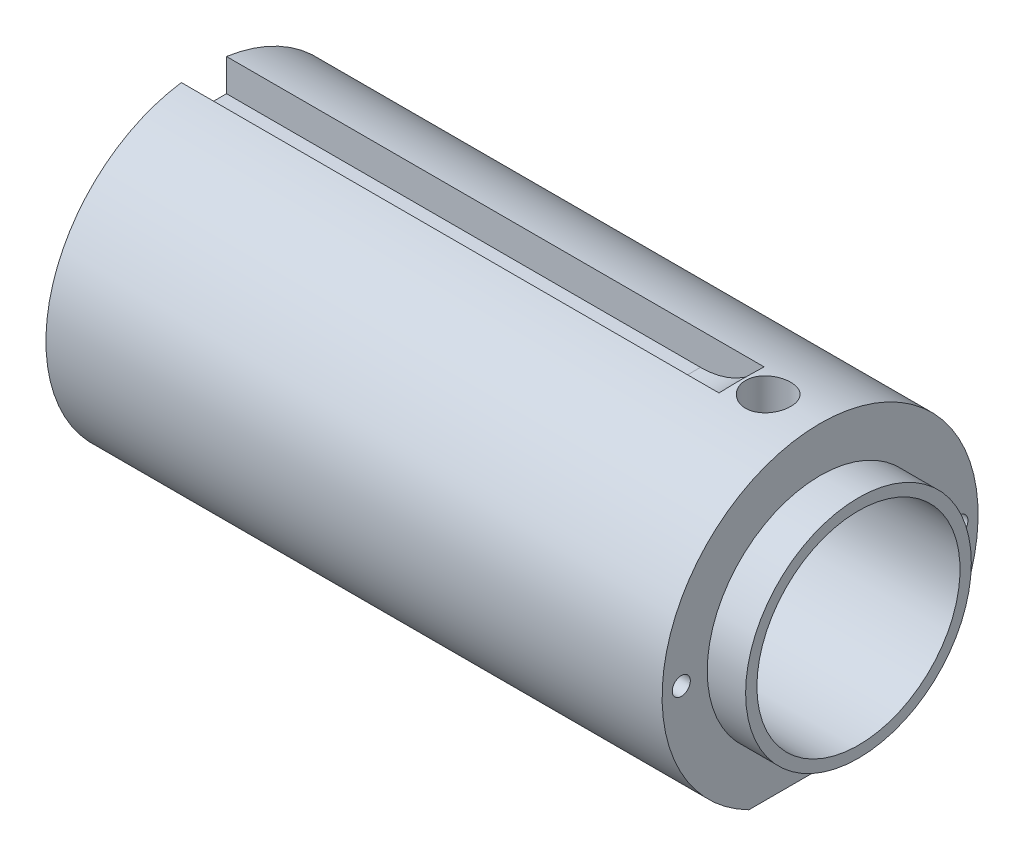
ISO-10303-21;
HEADER;
FILE_DESCRIPTION(('STEP AP214'),'2;1');
FILE_NAME('part.step','',(''),(''),'','','');
FILE_SCHEMA(('AUTOMOTIVE_DESIGN { 1 0 10303 214 1 1 1 1 }'));
ENDSEC;
DATA;
#1=APPLICATION_CONTEXT('core data for automotive mechanical design processes');
#2=APPLICATION_PROTOCOL_DEFINITION('international standard','automotive_design',2000,#1);
#3=PRODUCT_CONTEXT('',#1,'mechanical');
#4=PRODUCT('Part','Part','',(#3));
#5=PRODUCT_RELATED_PRODUCT_CATEGORY('part','',(#4));
#6=PRODUCT_DEFINITION_FORMATION('','',#4);
#7=PRODUCT_DEFINITION_CONTEXT('part definition',#1,'design');
#8=PRODUCT_DEFINITION('design','',#6,#7);
#9=PRODUCT_DEFINITION_SHAPE('','',#8);
#10=(LENGTH_UNIT() NAMED_UNIT(*) SI_UNIT(.MILLI.,.METRE.));
#11=(NAMED_UNIT(*) PLANE_ANGLE_UNIT() SI_UNIT($,.RADIAN.));
#12=(NAMED_UNIT(*) SI_UNIT($,.STERADIAN.) SOLID_ANGLE_UNIT());
#13=UNCERTAINTY_MEASURE_WITH_UNIT(LENGTH_MEASURE(1.E-05),#10,'distance_accuracy_value','');
#14=(GEOMETRIC_REPRESENTATION_CONTEXT(3) GLOBAL_UNCERTAINTY_ASSIGNED_CONTEXT((#13)) GLOBAL_UNIT_ASSIGNED_CONTEXT((#10,
#11,#12)) REPRESENTATION_CONTEXT('',''));
#15=CARTESIAN_POINT('',(0.,0.,0.));
#16=DIRECTION('',(0.,0.,1.));
#17=DIRECTION('',(1.,0.,0.));
#18=AXIS2_PLACEMENT_3D('',#15,#16,#17);
#19=CARTESIAN_POINT('',(58.,-12.5,-14.0663374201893));
#20=DIRECTION('',(0.,1.,0.));
#21=DIRECTION('',(0.,0.,1.));
#22=AXIS2_PLACEMENT_3D('',#19,#20,#21);
#23=PLANE('',#22);
#24=DIRECTION('',(0.,0.,-1.));
#25=VECTOR('',#24,1.);
#26=CARTESIAN_POINT('',(54.6,-12.5,0.));
#27=LINE('',#26,#25);
#28=CARTESIAN_POINT('',(54.6,-12.5,6.30476010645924));
#29=VERTEX_POINT('',#28);
#30=CARTESIAN_POINT('',(54.6,-12.5,-6.30476010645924));
#31=VERTEX_POINT('',#30);
#32=EDGE_CURVE('E11',#29,#31,#27,.T.);
#33=ORIENTED_EDGE('',*,*,#32,.F.);
#34=DIRECTION('',(-1.,0.,0.));
#35=VECTOR('',#34,1.);
#36=CARTESIAN_POINT('',(0.,-12.5,6.30476010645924));
#37=LINE('',#36,#35);
#38=CARTESIAN_POINT('',(0.,-12.5,6.30476010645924));
#39=VERTEX_POINT('',#38);
#40=EDGE_CURVE('E271',#39,#29,#37,.F.);
#41=ORIENTED_EDGE('',*,*,#40,.F.);
#42=DIRECTION('',(0.,0.,-1.));
#43=VECTOR('',#42,1.);
#44=CARTESIAN_POINT('',(0.,-12.5,-14.0663374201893));
#45=LINE('',#44,#43);
#46=CARTESIAN_POINT('',(0.,-12.5,-6.30476010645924));
#47=VERTEX_POINT('',#46);
#48=EDGE_CURVE('E123',#39,#47,#45,.T.);
#49=ORIENTED_EDGE('',*,*,#48,.T.);
#50=DIRECTION('',(-1.,0.,0.));
#51=VECTOR('',#50,1.);
#52=CARTESIAN_POINT('',(0.,-12.5,-6.30476010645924));
#53=LINE('',#52,#51);
#54=EDGE_CURVE('E44',#31,#47,#53,.T.);
#55=ORIENTED_EDGE('',*,*,#54,.F.);
#56=EDGE_LOOP('',(#33,#41,#49,#55));
#57=FACE_BOUND('',#56,.T.);
#58=CARTESIAN_POINT('',(18.,-12.5,0.));
#59=DIRECTION('',(0.,-1.,0.));
#60=DIRECTION('',(0.,0.,-1.));
#61=AXIS2_PLACEMENT_3D('',#58,#59,#60);
#62=CIRCLE('',#61,2.99999999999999);
#63=CARTESIAN_POINT('',(18.,-12.5,-2.99999999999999));
#64=VERTEX_POINT('',#63);
#65=EDGE_CURVE('E113',#64,#64,#62,.T.);
#66=ORIENTED_EDGE('',*,*,#65,.F.);
#67=EDGE_LOOP('',(#66));
#68=FACE_BOUND('',#67,.T.);
#69=ADVANCED_FACE('F29',(#57,#68),#23,.F.);
#70=CARTESIAN_POINT('',(0.,0.,0.));
#71=DIRECTION('',(-1.,0.,0.));
#72=DIRECTION('',(0.,0.,1.));
#73=AXIS2_PLACEMENT_3D('',#70,#71,#72);
#74=CYLINDRICAL_SURFACE('',#73,9.1);
#75=CARTESIAN_POINT('',(14.,0.,0.));
#76=DIRECTION('',(-1.,0.,0.));
#77=DIRECTION('',(0.,0.,1.));
#78=AXIS2_PLACEMENT_3D('',#75,#76,#77);
#79=CIRCLE('',#78,9.1);
#80=CARTESIAN_POINT('',(14.,0.,9.1));
#81=VERTEX_POINT('',#80);
#82=EDGE_CURVE('E197',#81,#81,#79,.T.);
#83=ORIENTED_EDGE('',*,*,#82,.F.);
#84=EDGE_LOOP('',(#83));
#85=FACE_BOUND('',#84,.T.);
#86=CARTESIAN_POINT('',(0.,0.,0.));
#87=DIRECTION('',(-1.,0.,0.));
#88=DIRECTION('',(0.,0.,1.));
#89=AXIS2_PLACEMENT_3D('',#86,#87,#88);
#90=CIRCLE('',#89,9.1);
#91=CARTESIAN_POINT('',(0.,0.,9.1));
#92=VERTEX_POINT('',#91);
#93=EDGE_CURVE('E211',#92,#92,#90,.T.);
#94=ORIENTED_EDGE('',*,*,#93,.T.);
#95=EDGE_LOOP('',(#94));
#96=FACE_BOUND('',#95,.T.);
#97=ADVANCED_FACE('F31',(#85,#96),#74,.F.);
#98=CARTESIAN_POINT('',(0.,9.1,0.));
#99=DIRECTION('',(1.,0.,0.));
#100=DIRECTION('',(0.,0.,-1.));
#101=AXIS2_PLACEMENT_3D('',#98,#99,#100);
#102=PLANE('',#101);
#103=ORIENTED_EDGE('',*,*,#93,.F.);
#104=EDGE_LOOP('',(#103));
#105=FACE_BOUND('',#104,.T.);
#106=CARTESIAN_POINT('',(0.,0.,0.));
#107=DIRECTION('',(-1.,0.,0.));
#108=DIRECTION('',(0.,0.,1.));
#109=AXIS2_PLACEMENT_3D('',#106,#107,#108);
#110=CIRCLE('',#109,14.);
#111=CARTESIAN_POINT('',(0.,13.856406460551,-2.));
#112=VERTEX_POINT('',#111);
#113=EDGE_CURVE('E244',#112,#47,#110,.T.);
#114=ORIENTED_EDGE('',*,*,#113,.T.);
#115=ORIENTED_EDGE('',*,*,#48,.F.);
#116=CARTESIAN_POINT('',(0.,13.856406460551,2.));
#117=VERTEX_POINT('',#116);
#118=EDGE_CURVE('E51',#39,#117,#110,.T.);
#119=ORIENTED_EDGE('',*,*,#118,.T.);
#120=DIRECTION('',(0.,1.,0.));
#121=VECTOR('',#120,1.);
#122=CARTESIAN_POINT('',(0.,9.1,2.));
#123=LINE('',#122,#121);
#124=CARTESIAN_POINT('',(0.,11.,2.));
#125=VERTEX_POINT('',#124);
#126=EDGE_CURVE('E256',#125,#117,#123,.T.);
#127=ORIENTED_EDGE('',*,*,#126,.F.);
#128=DIRECTION('',(0.,0.,-1.));
#129=VECTOR('',#128,1.);
#130=CARTESIAN_POINT('',(0.,11.,0.));
#131=LINE('',#130,#129);
#132=CARTESIAN_POINT('',(0.,11.,-2.));
#133=VERTEX_POINT('',#132);
#134=EDGE_CURVE('E37',#125,#133,#131,.T.);
#135=ORIENTED_EDGE('',*,*,#134,.T.);
#136=DIRECTION('',(0.,1.,0.));
#137=VECTOR('',#136,1.);
#138=CARTESIAN_POINT('',(0.,9.1,-2.));
#139=LINE('',#138,#137);
#140=EDGE_CURVE('E195',#133,#112,#139,.T.);
#141=ORIENTED_EDGE('',*,*,#140,.T.);
#142=EDGE_LOOP('',(#114,#115,#119,#127,#135,#141));
#143=FACE_BOUND('',#142,.T.);
#144=ADVANCED_FACE('F149',(#105,#143),#102,.F.);
#145=CARTESIAN_POINT('',(0.,0.,0.));
#146=DIRECTION('',(-1.,0.,0.));
#147=DIRECTION('',(0.,0.,1.));
#148=AXIS2_PLACEMENT_3D('',#145,#146,#147);
#149=CYLINDRICAL_SURFACE('',#148,14.);
#150=CARTESIAN_POINT('',(50.,13.856406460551,2.00000000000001));
#151=CARTESIAN_POINT('',(49.8882758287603,13.8564082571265,1.9999953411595));
#152=CARTESIAN_POINT('',(49.7764852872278,13.8577723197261,1.99060664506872));
#153=CARTESIAN_POINT('',(49.5560253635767,13.8630779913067,1.95330740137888));
#154=CARTESIAN_POINT('',(49.4473592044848,13.8670221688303,1.92537839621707));
#155=CARTESIAN_POINT('',(49.2363712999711,13.8770324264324,1.85184738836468));
#156=CARTESIAN_POINT('',(49.1340449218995,13.8830969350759,1.8062584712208));
#157=CARTESIAN_POINT('',(48.9385102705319,13.8966626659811,1.69873175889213));
#158=CARTESIAN_POINT('',(48.8453006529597,13.9041636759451,1.63679637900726));
#159=CARTESIAN_POINT('',(48.6699517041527,13.9198182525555,1.49785346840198));
#160=CARTESIAN_POINT('',(48.5878882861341,13.9279757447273,1.42075056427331));
#161=CARTESIAN_POINT('',(48.4378184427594,13.9439890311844,1.25386707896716));
#162=CARTESIAN_POINT('',(48.3698127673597,13.9518448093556,1.16408582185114));
#163=CARTESIAN_POINT('',(48.2495109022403,13.9664103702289,0.973910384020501));
#164=CARTESIAN_POINT('',(48.1972842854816,13.9731150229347,0.8734717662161));
#165=CARTESIAN_POINT('',(48.1104692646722,13.9845795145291,0.665136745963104));
#166=CARTESIAN_POINT('',(48.0758800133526,13.9893394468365,0.557240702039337));
#167=CARTESIAN_POINT('',(48.0255507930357,13.9963505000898,0.337834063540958));
#168=CARTESIAN_POINT('',(48.0096839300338,13.9986185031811,0.226353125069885));
#169=CARTESIAN_POINT('',(47.9968561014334,14.0004479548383,0.00228956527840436));
#170=CARTESIAN_POINT('',(47.9998941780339,14.0000095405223,-0.110292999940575));
#171=CARTESIAN_POINT('',(48.0246893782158,13.9964890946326,-0.332498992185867));
#172=CARTESIAN_POINT('',(48.0463099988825,13.9934263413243,-0.442137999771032));
#173=CARTESIAN_POINT('',(48.1074425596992,13.9850228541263,-0.656215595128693));
#174=CARTESIAN_POINT('',(48.1469549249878,13.9796820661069,-0.760654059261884));
#175=CARTESIAN_POINT('',(48.2428907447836,13.9672894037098,-0.96178196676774));
#176=CARTESIAN_POINT('',(48.2993721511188,13.9602316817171,-1.05844339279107));
#177=CARTESIAN_POINT('',(48.4276004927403,13.9451926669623,-1.24096782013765));
#178=CARTESIAN_POINT('',(48.4993483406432,13.9372113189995,-1.32683017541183));
#179=CARTESIAN_POINT('',(48.656834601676,13.921132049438,-1.48612299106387));
#180=CARTESIAN_POINT('',(48.7426921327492,13.9130337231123,-1.55943569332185));
#181=CARTESIAN_POINT('',(48.9255545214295,13.8977029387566,-1.69062989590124));
#182=CARTESIAN_POINT('',(49.0225594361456,13.8904704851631,-1.74851131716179));
#183=CARTESIAN_POINT('',(49.2250802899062,13.8776905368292,-1.84721301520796));
#184=CARTESIAN_POINT('',(49.3306018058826,13.8721441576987,-1.88802200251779));
#185=CARTESIAN_POINT('',(49.5470975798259,13.8633846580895,-1.95130623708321));
#186=CARTESIAN_POINT('',(49.6580714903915,13.8601713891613,-1.97378265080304));
#187=CARTESIAN_POINT('',(49.88127653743,13.8564698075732,-1.99960390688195));
#188=CARTESIAN_POINT('',(49.9934880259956,13.8559577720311,-2.00311531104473));
#189=CARTESIAN_POINT('',(50.2168978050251,13.8576537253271,-1.99134808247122));
#190=CARTESIAN_POINT('',(50.3280961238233,13.8598616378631,-1.97606997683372));
#191=CARTESIAN_POINT('',(50.5458121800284,13.8667269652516,-1.92729837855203));
#192=CARTESIAN_POINT('',(50.6523487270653,13.8713733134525,-1.89388715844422));
#193=CARTESIAN_POINT('',(50.8583087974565,13.8825829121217,-1.80988306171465));
#194=CARTESIAN_POINT('',(50.9577319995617,13.8891462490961,-1.75928940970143));
#195=CARTESIAN_POINT('',(51.1473918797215,13.9035064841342,-1.64195360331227));
#196=CARTESIAN_POINT('',(51.2375609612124,13.911311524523,-1.57510320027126));
#197=CARTESIAN_POINT('',(51.4054597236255,13.9272509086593,-1.42730277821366));
#198=CARTESIAN_POINT('',(51.4831887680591,13.9353852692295,-1.34635203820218));
#199=CARTESIAN_POINT('',(51.6245952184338,13.9511405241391,-1.17191708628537));
#200=CARTESIAN_POINT('',(51.6881625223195,13.9587570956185,-1.07834317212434));
#201=CARTESIAN_POINT('',(51.7986755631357,13.972552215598,-0.881748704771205));
#202=CARTESIAN_POINT('',(51.845621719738,13.9787308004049,-0.778728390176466));
#203=CARTESIAN_POINT('',(51.9213821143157,13.9889347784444,-0.566515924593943));
#204=CARTESIAN_POINT('',(51.9502575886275,13.9929674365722,-0.457345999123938));
#205=CARTESIAN_POINT('',(51.9892554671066,13.9984555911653,-0.235645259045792));
#206=CARTESIAN_POINT('',(51.9993789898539,13.9999112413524,-0.123114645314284));
#207=CARTESIAN_POINT('',(52.0005602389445,14.0000800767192,0.101043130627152));
#208=CARTESIAN_POINT('',(51.9917868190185,13.998817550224,0.212669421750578));
#209=CARTESIAN_POINT('',(51.955783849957,13.9937406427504,0.432842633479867));
#210=CARTESIAN_POINT('',(51.9285543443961,13.989926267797,0.541389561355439));
#211=CARTESIAN_POINT('',(51.8564700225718,13.9801722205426,0.75228371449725));
#212=CARTESIAN_POINT('',(51.8116258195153,13.9742338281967,0.854634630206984));
#213=CARTESIAN_POINT('',(51.705602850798,13.9608856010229,1.05038570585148));
#214=CARTESIAN_POINT('',(51.6444236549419,13.9534757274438,1.14378562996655));
#215=CARTESIAN_POINT('',(51.5068522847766,13.9379304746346,1.31984194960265));
#216=CARTESIAN_POINT('',(51.4303350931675,13.9297894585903,1.40240016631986));
#217=CARTESIAN_POINT('',(51.2645224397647,13.9137422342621,1.55356716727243));
#218=CARTESIAN_POINT('',(51.1752239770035,13.9058360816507,1.62217266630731));
#219=CARTESIAN_POINT('',(50.9858545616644,13.8911108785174,1.74379523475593));
#220=CARTESIAN_POINT('',(50.8857313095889,13.8842975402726,1.79673154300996));
#221=CARTESIAN_POINT('',(50.6779677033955,13.8725962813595,1.88495902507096));
#222=CARTESIAN_POINT('',(50.5703354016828,13.8677063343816,1.92026877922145));
#223=CARTESIAN_POINT('',(50.3851635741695,13.8615529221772,1.96409255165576));
#224=CARTESIAN_POINT('',(50.3087756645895,13.859633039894,1.97753762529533));
#225=CARTESIAN_POINT('',(50.1549358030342,13.857059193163,1.99549291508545));
#226=CARTESIAN_POINT('',(50.0774838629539,13.8564052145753,2.00000323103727));
#227=CARTESIAN_POINT('',(50.,13.856406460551,2.00000000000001));
#228=B_SPLINE_CURVE_WITH_KNOTS('',3,(#150,#151,#152,#153,#154,#155,#156,#157,#158,#159,#160,
#161,#162,#163,#164,#165,#166,#167,#168,#169,#170,#171,#172,#173,#174,#175,#176,#177,#178,#179,
#180,#181,#182,#183,#184,#185,#186,#187,#188,#189,#190,#191,#192,#193,#194,#195,#196,#197,#198,
#199,#200,#201,#202,#203,#204,#205,#206,#207,#208,#209,#210,#211,#212,#213,#214,#215,#216,#217,
#218,#219,#220,#221,#222,#223,#224,#225,#226,#227),.UNSPECIFIED.,.T.,.F.,(4,2,2,2,2,2,2,2,2,2,2,
2,2,2,2,2,2,2,2,2,2,2,2,2,2,2,2,2,2,2,2,2,2,2,2,2,2,2,4),(0.,0.334889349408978,
0.670112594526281,1.00508792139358,1.34001378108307,1.67711715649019,2.01423851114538,
2.35282530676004,2.69139583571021,3.02765822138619,3.36390357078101,3.69769984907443,
4.03150405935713,4.36646147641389,4.70143892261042,5.03940517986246,5.3773731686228,
5.71556429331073,6.05373389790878,6.38892861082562,6.72411392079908,7.05779100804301,
7.39148315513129,7.72746121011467,8.06345644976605,8.40197921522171,8.74049343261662,
9.07785422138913,9.41519488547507,9.7495337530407,10.0838718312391,10.4180087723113,
10.7521545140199,11.0891434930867,11.426211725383,11.7649881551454,12.103406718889,
12.3356645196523,12.5679197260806),.UNSPECIFIED.);
#229=CARTESIAN_POINT('',(52.,14.,0.));
#230=VERTEX_POINT('',#229);
#231=CARTESIAN_POINT('',(48.,14.,0.));
#232=VERTEX_POINT('',#231);
#233=EDGE_CURVE('E187',#230,#232,#228,.T.);
#234=ORIENTED_EDGE('',*,*,#233,.T.);
#235=EDGE_CURVE('E193',#232,#230,#228,.T.);
#236=ORIENTED_EDGE('',*,*,#235,.T.);
#237=EDGE_LOOP('',(#234,#236));
#238=FACE_BOUND('',#237,.T.);
#239=CARTESIAN_POINT('',(54.6,0.,0.));
#240=DIRECTION('',(-1.,0.,0.));
#241=DIRECTION('',(0.,0.,1.));
#242=AXIS2_PLACEMENT_3D('',#239,#240,#241);
#243=CIRCLE('',#242,14.);
#244=EDGE_CURVE('E237',#29,#31,#243,.T.);
#245=ORIENTED_EDGE('',*,*,#244,.T.);
#246=ORIENTED_EDGE('',*,*,#54,.T.);
#247=ORIENTED_EDGE('',*,*,#113,.F.);
#248=DIRECTION('',(-1.,0.,0.));
#249=VECTOR('',#248,1.);
#250=CARTESIAN_POINT('',(0.,13.856406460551,-2.));
#251=LINE('',#250,#249);
#252=CARTESIAN_POINT('',(47.6418642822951,13.856406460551,-2.));
#253=VERTEX_POINT('',#252);
#254=EDGE_CURVE('E175',#112,#253,#251,.F.);
#255=ORIENTED_EDGE('',*,*,#254,.T.);
#256=CARTESIAN_POINT('',(47.744562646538,14.,0.));
#257=CARTESIAN_POINT('',(47.7445658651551,13.9999982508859,0.296426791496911));
#258=CARTESIAN_POINT('',(47.7380349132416,13.9905743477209,0.592897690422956));
#259=CARTESIAN_POINT('',(47.71157986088,13.9529796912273,1.18411882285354));
#260=CARTESIAN_POINT('',(47.6916519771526,13.9248036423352,1.47886854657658));
#261=CARTESIAN_POINT('',(47.6373654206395,13.8500298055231,2.06494676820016));
#262=CARTESIAN_POINT('',(47.6029949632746,13.8034169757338,2.3562722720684));
#263=CARTESIAN_POINT('',(47.518140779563,13.692446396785,2.93310363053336));
#264=CARTESIAN_POINT('',(47.4676618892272,13.6280939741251,3.21861120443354));
#265=CARTESIAN_POINT('',(47.361364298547,13.4987645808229,3.71951566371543));
#266=CARTESIAN_POINT('',(47.3091603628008,13.4370363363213,3.93652472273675));
#267=CARTESIAN_POINT('',(47.1921049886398,13.3042690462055,4.36423346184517));
#268=CARTESIAN_POINT('',(47.1272535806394,13.233230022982,4.57493315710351));
#269=CARTESIAN_POINT('',(46.9834434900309,13.0830824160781,4.98810504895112));
#270=CARTESIAN_POINT('',(46.9045076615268,13.0039869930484,5.19058993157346));
#271=CARTESIAN_POINT('',(46.7307705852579,12.8391723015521,5.58582495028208));
#272=CARTESIAN_POINT('',(46.6359743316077,12.7534551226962,5.77857812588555));
#273=CARTESIAN_POINT('',(46.4556217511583,12.6002249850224,6.10391840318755));
#274=CARTESIAN_POINT('',(46.374010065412,12.5337331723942,6.23917956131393));
#275=CARTESIAN_POINT('',(46.200534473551,12.3993256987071,6.50219302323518));
#276=CARTESIAN_POINT('',(46.1086731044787,12.331410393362,6.62994717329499));
#277=CARTESIAN_POINT('',(45.9142515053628,12.1954609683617,6.87681340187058));
#278=CARTESIAN_POINT('',(45.8117006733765,12.1274270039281,6.99593291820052));
#279=CARTESIAN_POINT('',(45.5956169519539,11.9926889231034,7.22447522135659));
#280=CARTESIAN_POINT('',(45.4820860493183,11.9259845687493,7.33389975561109));
#281=CARTESIAN_POINT('',(45.1676420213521,11.7537684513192,7.60850030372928));
#282=CARTESIAN_POINT('',(44.9572127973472,11.6506666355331,7.76467352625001));
#283=CARTESIAN_POINT('',(44.6208772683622,11.5080109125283,7.97326013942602));
#284=CARTESIAN_POINT('',(44.5052617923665,11.4624412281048,8.03853303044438));
#285=CARTESIAN_POINT('',(44.2676235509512,11.3762683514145,8.16002692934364));
#286=CARTESIAN_POINT('',(44.1456039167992,11.3356627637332,8.21625230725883));
#287=CARTESIAN_POINT('',(43.8950539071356,11.2601183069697,8.31948711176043));
#288=CARTESIAN_POINT('',(43.766487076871,11.2252170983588,8.36643568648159));
#289=CARTESIAN_POINT('',(43.5044676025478,11.162257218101,8.45025226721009));
#290=CARTESIAN_POINT('',(43.3710148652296,11.1341986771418,8.48712008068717));
#291=CARTESIAN_POINT('',(43.1003466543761,11.0856571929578,8.55042684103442));
#292=CARTESIAN_POINT('',(42.9631322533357,11.0651721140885,8.57686872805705));
#293=CARTESIAN_POINT('',(42.6861208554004,11.0323114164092,8.61909654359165));
#294=CARTESIAN_POINT('',(42.5463241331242,11.019934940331,8.63488359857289));
#295=CARTESIAN_POINT('',(42.2804181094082,11.0044892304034,8.6545566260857));
#296=CARTESIAN_POINT('',(42.1544369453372,11.0005690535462,8.65953112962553));
#297=CARTESIAN_POINT('',(41.9024026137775,10.9995463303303,8.6608303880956));
#298=CARTESIAN_POINT('',(41.7763494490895,11.0024435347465,8.65715545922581));
#299=CARTESIAN_POINT('',(41.5251699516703,11.0149914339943,8.64118427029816));
#300=CARTESIAN_POINT('',(41.400043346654,11.0246400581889,8.62889065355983));
#301=CARTESIAN_POINT('',(41.151610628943,11.0504795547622,8.59577462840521));
#302=CARTESIAN_POINT('',(41.0283045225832,11.0666704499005,8.57495219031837));
#303=CARTESIAN_POINT('',(40.7880694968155,11.1046712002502,8.52567968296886));
#304=CARTESIAN_POINT('',(40.671060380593,11.1262970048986,8.49747840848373));
#305=CARTESIAN_POINT('',(40.4403046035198,11.1749516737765,8.43339006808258));
#306=CARTESIAN_POINT('',(40.3265590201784,11.2019822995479,8.3975004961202));
#307=CARTESIAN_POINT('',(39.9913187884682,11.2904218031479,8.27865699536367));
#308=CARTESIAN_POINT('',(39.7756038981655,11.3592139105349,8.18448358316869));
#309=CARTESIAN_POINT('',(39.3523140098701,11.5158863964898,7.96264722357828));
#310=CARTESIAN_POINT('',(39.1459243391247,11.6046382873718,7.83336718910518));
#311=CARTESIAN_POINT('',(38.7578836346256,11.7923286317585,7.5478531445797));
#312=CARTESIAN_POINT('',(38.5762445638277,11.8912719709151,7.39160618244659));
#313=CARTESIAN_POINT('',(38.2865270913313,12.0645148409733,7.10402474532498));
#314=CARTESIAN_POINT('',(38.1722204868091,12.1378192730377,6.97824481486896));
#315=CARTESIAN_POINT('',(37.9562221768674,12.2846773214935,6.71634024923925));
#316=CARTESIAN_POINT('',(37.8545347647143,12.358231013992,6.58021211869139));
#317=CARTESIAN_POINT('',(37.6631030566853,12.5040164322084,6.29878830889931));
#318=CARTESIAN_POINT('',(37.5733790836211,12.5762457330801,6.15347763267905));
#319=CARTESIAN_POINT('',(37.4052762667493,12.7178988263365,5.85511308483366));
#320=CARTESIAN_POINT('',(37.3269005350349,12.7873218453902,5.70205710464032));
#321=CARTESIAN_POINT('',(37.1537000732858,12.9470852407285,5.33171776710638));
#322=CARTESIAN_POINT('',(37.0634524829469,13.035709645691,5.11154547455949));
#323=CARTESIAN_POINT('',(36.9003602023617,13.203401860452,4.66132654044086));
#324=CARTESIAN_POINT('',(36.8275220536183,13.2824660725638,4.43127622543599));
#325=CARTESIAN_POINT('',(36.6971200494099,13.4295375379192,3.96329720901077));
#326=CARTESIAN_POINT('',(36.6395663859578,13.4975374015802,3.72536336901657));
#327=CARTESIAN_POINT('',(36.5379661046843,13.6213479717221,3.24357170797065));
#328=CARTESIAN_POINT('',(36.4939183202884,13.6771597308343,2.999714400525));
#329=CARTESIAN_POINT('',(36.4167056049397,13.7773302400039,2.50037963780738));
#330=CARTESIAN_POINT('',(36.3838963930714,13.8213065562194,2.24477087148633));
#331=CARTESIAN_POINT('',(36.3297444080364,13.8950893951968,1.73032604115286));
#332=CARTESIAN_POINT('',(36.30840182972,13.9248956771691,1.47148992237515));
#333=CARTESIAN_POINT('',(36.2763450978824,13.9700443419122,0.951797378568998));
#334=CARTESIAN_POINT('',(36.2656354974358,13.9853805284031,0.690940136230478));
#335=CARTESIAN_POINT('',(36.2544380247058,14.0014248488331,0.168550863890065));
#336=CARTESIAN_POINT('',(36.2539508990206,14.0021319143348,-0.0929812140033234));
#337=CARTESIAN_POINT('',(36.2641384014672,13.9875157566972,-0.67030832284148));
#338=CARTESIAN_POINT('',(36.2771743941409,13.9688008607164,-0.985984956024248));
#339=CARTESIAN_POINT('',(36.318915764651,13.9101868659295,-1.61440796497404));
#340=CARTESIAN_POINT('',(36.3476250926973,13.8702824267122,-1.92715358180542));
#341=CARTESIAN_POINT('',(36.4223317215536,13.7699251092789,-2.54709802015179));
#342=CARTESIAN_POINT('',(36.4683202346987,13.7094826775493,-2.85429957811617));
#343=CARTESIAN_POINT('',(36.580077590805,13.5691407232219,-3.46050093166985));
#344=CARTESIAN_POINT('',(36.6458371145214,13.4892503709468,-3.75950451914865));
#345=CARTESIAN_POINT('',(36.7760059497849,13.3399246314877,-4.25327797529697));
#346=CARTESIAN_POINT('',(36.8342650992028,13.2751733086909,-4.45110658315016));
#347=CARTESIAN_POINT('',(36.9628570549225,13.138310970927,-4.84017149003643));
#348=CARTESIAN_POINT('',(37.0331868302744,13.0662018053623,-5.03140942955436));
#349=CARTESIAN_POINT('',(37.1871767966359,12.9158786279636,-5.40561583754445));
#350=CARTESIAN_POINT('',(37.2708175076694,12.8376736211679,-5.58859589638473));
#351=CARTESIAN_POINT('',(37.4528879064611,12.6766047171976,-5.94490317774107));
#352=CARTESIAN_POINT('',(37.5513136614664,12.5937420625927,-6.11823295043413));
#353=CARTESIAN_POINT('',(37.7389764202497,12.4453275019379,-6.41360449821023));
#354=CARTESIAN_POINT('',(37.8248578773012,12.3803300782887,-6.53806180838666));
#355=CARTESIAN_POINT('',(38.0064333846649,12.2498767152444,-6.77932957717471));
#356=CARTESIAN_POINT('',(38.1021250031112,12.1844208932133,-6.89614191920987));
#357=CARTESIAN_POINT('',(38.3035804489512,12.0543423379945,-7.12107453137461));
#358=CARTESIAN_POINT('',(38.4093366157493,11.989719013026,-7.22920129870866));
#359=CARTESIAN_POINT('',(38.6310892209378,11.8626751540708,-7.43583509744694));
#360=CARTESIAN_POINT('',(38.7470839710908,11.8002542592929,-7.53434370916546));
#361=CARTESIAN_POINT('',(38.9687509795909,11.6893585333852,-7.70502754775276));
#362=CARTESIAN_POINT('',(39.0728724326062,11.6403052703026,-7.77884383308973));
#363=CARTESIAN_POINT('',(39.2878035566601,11.5457170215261,-7.91855627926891));
#364=CARTESIAN_POINT('',(39.3986120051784,11.5001813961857,-7.9844538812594));
#365=CARTESIAN_POINT('',(39.6265158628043,11.4135415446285,-8.10782069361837));
#366=CARTESIAN_POINT('',(39.7436122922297,11.3724380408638,-8.16528853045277));
#367=CARTESIAN_POINT('',(39.9834117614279,11.2955824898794,-8.27128183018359));
#368=CARTESIAN_POINT('',(40.1061121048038,11.2598279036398,-8.31981153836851));
#369=CARTESIAN_POINT('',(40.3570780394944,11.1942879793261,-8.40779080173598));
#370=CARTESIAN_POINT('',(40.4853702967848,11.1645362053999,-8.4471894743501));
#371=CARTESIAN_POINT('',(40.7459502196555,11.1119651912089,-8.51622661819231));
#372=CARTESIAN_POINT('',(40.8782379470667,11.0891460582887,-8.54586493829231));
#373=CARTESIAN_POINT('',(41.1457048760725,11.0510127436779,-8.59512010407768));
#374=CARTESIAN_POINT('',(41.2808834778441,11.035697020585,-8.61473900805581));
#375=CARTESIAN_POINT('',(41.5529835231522,11.0129541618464,-8.64379456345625));
#376=CARTESIAN_POINT('',(41.6899048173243,11.0055263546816,-8.653232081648));
#377=CARTESIAN_POINT('',(41.9515608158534,10.9990596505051,-8.66144943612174));
#378=CARTESIAN_POINT('',(42.0762508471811,10.9993081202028,-8.66113462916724));
#379=CARTESIAN_POINT('',(42.3251775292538,11.0064482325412,-8.65205939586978));
#380=CARTESIAN_POINT('',(42.4494140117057,11.0133421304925,-8.64329610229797));
#381=CARTESIAN_POINT('',(42.6963918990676,11.0336249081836,-8.6173888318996));
#382=CARTESIAN_POINT('',(42.8191341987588,11.0470096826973,-8.60025015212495));
#383=CARTESIAN_POINT('',(43.0623730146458,11.079997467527,-8.55770877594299));
#384=CARTESIAN_POINT('',(43.182868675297,11.099602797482,-8.5323029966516));
#385=CARTESIAN_POINT('',(43.4188369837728,11.1442665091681,-8.47388054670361));
#386=CARTESIAN_POINT('',(43.5343593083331,11.1692318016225,-8.44099329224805));
#387=CARTESIAN_POINT('',(43.7617215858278,11.2243046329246,-8.36762134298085));
#388=CARTESIAN_POINT('',(43.8735602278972,11.2544139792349,-8.32713397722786));
#389=CARTESIAN_POINT('',(44.2025304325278,11.3516175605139,-8.19468029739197));
#390=CARTESIAN_POINT('',(44.41331428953,11.4256261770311,-8.09167309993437));
#391=CARTESIAN_POINT('',(44.8279427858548,11.5924836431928,-7.85093354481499));
#392=CARTESIAN_POINT('',(45.0302628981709,11.6862900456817,-7.71127185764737));
#393=CARTESIAN_POINT('',(45.4090168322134,11.8824720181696,-7.40538963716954));
#394=CARTESIAN_POINT('',(45.5854381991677,11.984851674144,-7.23915640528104));
#395=CARTESIAN_POINT('',(45.8683100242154,12.1642280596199,-6.93211464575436));
#396=CARTESIAN_POINT('',(45.9808298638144,12.2406602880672,-6.79646163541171));
#397=CARTESIAN_POINT('',(46.1925459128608,12.3929010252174,-6.51472377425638));
#398=CARTESIAN_POINT('',(46.2917372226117,12.4687092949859,-6.36863511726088));
#399=CARTESIAN_POINT('',(46.4776711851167,12.6181116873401,-6.06725701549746));
#400=CARTESIAN_POINT('',(46.5643894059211,12.6917012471,-5.91195033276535));
#401=CARTESIAN_POINT('',(46.7261040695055,12.8351554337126,-5.59368254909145));
#402=CARTESIAN_POINT('',(46.8010972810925,12.9050190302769,-5.43071935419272));
#403=CARTESIAN_POINT('',(46.9660899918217,13.0648583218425,-5.03684147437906));
#404=CARTESIAN_POINT('',(47.0513812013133,13.1527158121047,-4.8030866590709));
#405=CARTESIAN_POINT('',(47.2042760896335,13.3172530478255,-4.32602877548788));
#406=CARTESIAN_POINT('',(47.2718725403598,13.3939282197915,-4.08272185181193));
#407=CARTESIAN_POINT('',(47.3915761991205,13.5346407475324,-3.58879516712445));
#408=CARTESIAN_POINT('',(47.4436835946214,13.5986782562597,-3.33817549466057));
#409=CARTESIAN_POINT('',(47.5342668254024,13.713134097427,-2.83150083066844));
#410=CARTESIAN_POINT('',(47.5727457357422,13.7635555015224,-2.57544707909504));
#411=CARTESIAN_POINT('',(47.6290393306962,13.8388121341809,-2.12710330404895));
#412=CARTESIAN_POINT('',(47.6496267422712,13.8668897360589,-1.93569026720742));
#413=CARTESIAN_POINT('',(47.6846100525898,13.915137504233,-1.55128011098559));
#414=CARTESIAN_POINT('',(47.6990051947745,13.93530670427,-1.3582828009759));
#415=CARTESIAN_POINT('',(47.7219092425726,13.9676127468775,-0.971327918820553));
#416=CARTESIAN_POINT('',(47.7304198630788,13.9797519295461,-0.777370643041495));
#417=CARTESIAN_POINT('',(47.7417457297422,13.9959464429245,-0.388948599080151));
#418=CARTESIAN_POINT('',(47.7445605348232,14.000001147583,-0.194483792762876));
#419=CARTESIAN_POINT('',(47.744562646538,14.,0.));
#420=B_SPLINE_CURVE_WITH_KNOTS('',3,(#256,#257,#258,#259,#260,#261,#262,#263,#264,#265,#266,
#267,#268,#269,#270,#271,#272,#273,#274,#275,#276,#277,#278,#279,#280,#281,#282,#283,#284,#285,
#286,#287,#288,#289,#290,#291,#292,#293,#294,#295,#296,#297,#298,#299,#300,#301,#302,#303,#304,
#305,#306,#307,#308,#309,#310,#311,#312,#313,#314,#315,#316,#317,#318,#319,#320,#321,#322,#323,
#324,#325,#326,#327,#328,#329,#330,#331,#332,#333,#334,#335,#336,#337,#338,#339,#340,#341,#342,
#343,#344,#345,#346,#347,#348,#349,#350,#351,#352,#353,#354,#355,#356,#357,#358,#359,#360,#361,
#362,#363,#364,#365,#366,#367,#368,#369,#370,#371,#372,#373,#374,#375,#376,#377,#378,#379,#380,
#381,#382,#383,#384,#385,#386,#387,#388,#389,#390,#391,#392,#393,#394,#395,#396,#397,#398,#399,
#400,#401,#402,#403,#404,#405,#406,#407,#408,#409,#410,#411,#412,#413,#414,#415,#416,#417,#418,
#419),.UNSPECIFIED.,.T.,.F.,(4,2,2,2,2,2,2,2,2,2,2,2,2,2,2,2,2,2,2,2,2,2,2,2,2,2,2,2,2,2,2,2,2,
2,2,2,2,2,2,2,2,2,2,2,2,2,2,2,2,2,2,2,2,2,2,2,2,2,2,2,2,2,2,2,2,2,2,2,2,2,2,2,2,2,2,2,2,2,2,2,2,
4),(0.,0.88913402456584,1.77851924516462,2.66863158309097,3.55847694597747,4.25265879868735,
4.94683898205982,5.63990283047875,6.33274885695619,6.84651747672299,7.36015920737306,
7.87335309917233,8.38645430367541,9.22710751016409,9.64780172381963,10.0682921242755,
10.4914553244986,10.9146266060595,11.3376784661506,11.7606855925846,12.1386361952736,
12.5165729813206,12.8943939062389,13.2722161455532,13.6386515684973,14.0052066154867,
14.737652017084,15.5123035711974,16.2873282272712,16.8419131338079,17.3966862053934,
17.9523900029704,18.5082459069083,19.2688779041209,20.0297952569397,20.7912187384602,
21.5525764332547,22.3361874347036,23.119811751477,23.9037714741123,24.6877884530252,
25.6361671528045,26.5847849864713,27.5329210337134,28.4806108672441,29.1285869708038,
29.7764006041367,30.4232747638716,31.0699771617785,31.5633281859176,32.0565572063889,
32.5494137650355,33.042189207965,33.451986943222,33.86170998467,34.2714997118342,
34.681094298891,35.0929192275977,35.5047505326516,35.9164972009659,36.3282088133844,
36.7018245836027,37.0755671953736,37.4490737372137,37.8227197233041,38.1903369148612,
38.5580835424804,39.2929607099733,40.0793989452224,40.866214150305,41.4417950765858,
42.0175870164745,42.5944918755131,43.1715554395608,43.9620476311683,44.7528622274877,
45.543667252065,46.3342937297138,46.9177027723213,47.5011830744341,48.0844932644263,
48.6678486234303),.UNSPECIFIED.);
#421=CARTESIAN_POINT('',(47.6418642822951,13.856406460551,2.));
#422=VERTEX_POINT('',#421);
#423=EDGE_CURVE('E168',#253,#422,#420,.T.);
#424=ORIENTED_EDGE('',*,*,#423,.T.);
#425=DIRECTION('',(-1.,0.,0.));
#426=VECTOR('',#425,1.);
#427=CARTESIAN_POINT('',(0.,13.856406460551,2.));
#428=LINE('',#427,#426);
#429=EDGE_CURVE('E176',#117,#422,#428,.F.);
#430=ORIENTED_EDGE('',*,*,#429,.F.);
#431=ORIENTED_EDGE('',*,*,#118,.F.);
#432=ORIENTED_EDGE('',*,*,#40,.T.);
#433=EDGE_LOOP('',(#245,#246,#247,#255,#424,#430,#431,#432));
#434=FACE_BOUND('',#433,.T.);
#435=ADVANCED_FACE('F178',(#238,#434),#149,.T.);
#436=CARTESIAN_POINT('',(54.6,14.,0.));
#437=DIRECTION('',(-1.,0.,0.));
#438=DIRECTION('',(0.,0.,1.));
#439=AXIS2_PLACEMENT_3D('',#436,#437,#438);
#440=PLANE('',#439);
#441=CARTESIAN_POINT('',(54.6,0.,-12.3));
#442=DIRECTION('',(1.,0.,0.));
#443=DIRECTION('',(0.,0.,-1.));
#444=AXIS2_PLACEMENT_3D('',#441,#442,#443);
#445=CIRCLE('',#444,0.79999999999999);
#446=CARTESIAN_POINT('',(54.6,0.,-13.1));
#447=VERTEX_POINT('',#446);
#448=EDGE_CURVE('E102',#447,#447,#445,.T.);
#449=ORIENTED_EDGE('',*,*,#448,.F.);
#450=EDGE_LOOP('',(#449));
#451=FACE_BOUND('',#450,.T.);
#452=CARTESIAN_POINT('',(54.6,0.,12.3));
#453=DIRECTION('',(1.,0.,0.));
#454=DIRECTION('',(0.,0.,-1.));
#455=AXIS2_PLACEMENT_3D('',#452,#453,#454);
#456=CIRCLE('',#455,0.79999999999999);
#457=CARTESIAN_POINT('',(54.6,0.,11.5));
#458=VERTEX_POINT('',#457);
#459=EDGE_CURVE('E110',#458,#458,#456,.T.);
#460=ORIENTED_EDGE('',*,*,#459,.F.);
#461=EDGE_LOOP('',(#460));
#462=FACE_BOUND('',#461,.T.);
#463=ORIENTED_EDGE('',*,*,#244,.F.);
#464=ORIENTED_EDGE('',*,*,#32,.T.);
#465=EDGE_LOOP('',(#463,#464));
#466=FACE_BOUND('',#465,.T.);
#467=CARTESIAN_POINT('',(54.6,0.,0.));
#468=DIRECTION('',(-1.,0.,0.));
#469=DIRECTION('',(0.,0.,1.));
#470=AXIS2_PLACEMENT_3D('',#467,#468,#469);
#471=CIRCLE('',#470,10.);
#472=CARTESIAN_POINT('',(54.6,0.,10.));
#473=VERTEX_POINT('',#472);
#474=EDGE_CURVE('E231',#473,#473,#471,.T.);
#475=ORIENTED_EDGE('',*,*,#474,.T.);
#476=EDGE_LOOP('',(#475));
#477=FACE_BOUND('',#476,.T.);
#478=ADVANCED_FACE('F182',(#451,#462,#466,#477),#440,.F.);
#479=CARTESIAN_POINT('',(0.,0.,0.));
#480=DIRECTION('',(-1.,0.,0.));
#481=DIRECTION('',(0.,0.,1.));
#482=AXIS2_PLACEMENT_3D('',#479,#480,#481);
#483=CYLINDRICAL_SURFACE('',#482,10.);
#484=ORIENTED_EDGE('',*,*,#474,.F.);
#485=EDGE_LOOP('',(#484));
#486=FACE_BOUND('',#485,.T.);
#487=CARTESIAN_POINT('',(58.,0.,0.));
#488=DIRECTION('',(-1.,0.,0.));
#489=DIRECTION('',(0.,0.,1.));
#490=AXIS2_PLACEMENT_3D('',#487,#488,#489);
#491=CIRCLE('',#490,10.);
#492=CARTESIAN_POINT('',(58.,0.,10.));
#493=VERTEX_POINT('',#492);
#494=EDGE_CURVE('E234',#493,#493,#491,.T.);
#495=ORIENTED_EDGE('',*,*,#494,.T.);
#496=EDGE_LOOP('',(#495));
#497=FACE_BOUND('',#496,.T.);
#498=ADVANCED_FACE('F220',(#486,#497),#483,.T.);
#499=CARTESIAN_POINT('',(58.,10.,0.));
#500=DIRECTION('',(-1.,0.,0.));
#501=DIRECTION('',(0.,0.,1.));
#502=AXIS2_PLACEMENT_3D('',#499,#500,#501);
#503=PLANE('',#502);
#504=ORIENTED_EDGE('',*,*,#494,.F.);
#505=EDGE_LOOP('',(#504));
#506=FACE_BOUND('',#505,.T.);
#507=CARTESIAN_POINT('',(58.,0.,0.));
#508=DIRECTION('',(-1.,0.,0.));
#509=DIRECTION('',(0.,0.,1.));
#510=AXIS2_PLACEMENT_3D('',#507,#508,#509);
#511=CIRCLE('',#510,9.);
#512=CARTESIAN_POINT('',(58.,0.,9.));
#513=VERTEX_POINT('',#512);
#514=EDGE_CURVE('E235',#513,#513,#511,.T.);
#515=ORIENTED_EDGE('',*,*,#514,.T.);
#516=EDGE_LOOP('',(#515));
#517=FACE_BOUND('',#516,.T.);
#518=ADVANCED_FACE('F217',(#506,#517),#503,.F.);
#519=CARTESIAN_POINT('',(0.,0.,0.));
#520=DIRECTION('',(-1.,0.,0.));
#521=DIRECTION('',(0.,0.,1.));
#522=AXIS2_PLACEMENT_3D('',#519,#520,#521);
#523=CYLINDRICAL_SURFACE('',#522,9.);
#524=CARTESIAN_POINT('',(18.,-8.48528137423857,-2.99999999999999));
#525=CARTESIAN_POINT('',(18.1634045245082,-8.48528083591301,-3.00000077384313));
#526=CARTESIAN_POINT('',(18.3268043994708,-8.49005307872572,-2.98660435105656));
#527=CARTESIAN_POINT('',(18.6487632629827,-8.50852722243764,-2.93355339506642));
#528=CARTESIAN_POINT('',(18.8073214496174,-8.52223059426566,-2.89389453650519));
#529=CARTESIAN_POINT('',(19.1148806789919,-8.55684611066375,-2.78986645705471));
#530=CARTESIAN_POINT('',(19.2638997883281,-8.57774411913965,-2.72554566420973));
#531=CARTESIAN_POINT('',(19.5490801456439,-8.62437366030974,-2.57418488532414));
#532=CARTESIAN_POINT('',(19.6852385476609,-8.65010625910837,-2.48713988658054));
#533=CARTESIAN_POINT('',(19.9461598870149,-8.70463468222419,-2.28915343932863));
#534=CARTESIAN_POINT('',(20.0703462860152,-8.73350684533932,-2.17747302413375));
#535=CARTESIAN_POINT('',(20.2986204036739,-8.79041594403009,-1.93496300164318));
#536=CARTESIAN_POINT('',(20.4027048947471,-8.81845274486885,-1.80413032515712));
#537=CARTESIAN_POINT('',(20.5904366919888,-8.87141600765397,-1.52281352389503));
#538=CARTESIAN_POINT('',(20.6734799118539,-8.89624223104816,-1.37190573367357));
#539=CARTESIAN_POINT('',(20.8127747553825,-8.93908760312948,-1.05729366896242));
#540=CARTESIAN_POINT('',(20.8690335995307,-8.95710858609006,-0.893592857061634));
#541=CARTESIAN_POINT('',(20.9512075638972,-8.9837722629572,-0.564086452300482));
#542=CARTESIAN_POINT('',(20.978110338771,-8.99271944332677,-0.398552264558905));
#543=CARTESIAN_POINT('',(21.003948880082,-9.00130824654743,-0.0650936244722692));
#544=CARTESIAN_POINT('',(21.0028918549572,-9.00095226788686,0.102830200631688));
#545=CARTESIAN_POINT('',(20.9734672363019,-8.99118118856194,0.429310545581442));
#546=CARTESIAN_POINT('',(20.9461724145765,-8.98212194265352,0.587976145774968));
#547=CARTESIAN_POINT('',(20.8668210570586,-8.95640902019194,0.898330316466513));
#548=CARTESIAN_POINT('',(20.8147628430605,-8.93975482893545,1.05001841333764));
#549=CARTESIAN_POINT('',(20.6867360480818,-8.90027010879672,1.34445742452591));
#550=CARTESIAN_POINT('',(20.6104621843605,-8.87736127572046,1.48706466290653));
#551=CARTESIAN_POINT('',(20.436420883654,-8.82775179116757,1.75777297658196));
#552=CARTESIAN_POINT('',(20.3386474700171,-8.801050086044,1.88587000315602));
#553=CARTESIAN_POINT('',(20.1189768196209,-8.7451857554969,2.13030259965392));
#554=CARTESIAN_POINT('',(19.9961605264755,-8.71596645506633,2.24580047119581));
#555=CARTESIAN_POINT('',(19.7326538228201,-8.65942005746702,2.45483177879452));
#556=CARTESIAN_POINT('',(19.5919606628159,-8.63209325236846,2.54836182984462));
#557=CARTESIAN_POINT('',(19.2940391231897,-8.58211575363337,2.71196236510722));
#558=CARTESIAN_POINT('',(19.1366036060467,-8.55953727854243,2.78167939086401));
#559=CARTESIAN_POINT('',(18.8112858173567,-8.52244952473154,2.893329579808));
#560=CARTESIAN_POINT('',(18.6434079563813,-8.50793686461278,2.93527438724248));
#561=CARTESIAN_POINT('',(18.3100849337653,-8.48938908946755,2.98848384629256));
#562=CARTESIAN_POINT('',(18.144871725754,-8.48491080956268,3.00104728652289));
#563=CARTESIAN_POINT('',(17.8146715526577,-8.48570016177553,2.99881631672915));
#564=CARTESIAN_POINT('',(17.649684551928,-8.49096602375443,2.98402687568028));
#565=CARTESIAN_POINT('',(17.3305291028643,-8.51020854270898,2.92867695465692));
#566=CARTESIAN_POINT('',(17.1761837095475,-8.52387976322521,2.88901918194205));
#567=CARTESIAN_POINT('',(16.8763691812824,-8.55805661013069,2.7861415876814));
#568=CARTESIAN_POINT('',(16.7309016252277,-8.57856344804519,2.72291758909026));
#569=CARTESIAN_POINT('',(16.447858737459,-8.62490632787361,2.57242302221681));
#570=CARTESIAN_POINT('',(16.3106800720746,-8.65089076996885,2.48445335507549));
#571=CARTESIAN_POINT('',(16.0525618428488,-8.70497306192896,2.28775689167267));
#572=CARTESIAN_POINT('',(15.9316270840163,-8.73307153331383,2.17902397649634));
#573=CARTESIAN_POINT('',(15.7034160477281,-8.78985115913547,1.93767511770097));
#574=CARTESIAN_POINT('',(15.5970768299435,-8.81849530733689,1.80416181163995));
#575=CARTESIAN_POINT('',(15.4082515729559,-8.87180554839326,1.52048187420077));
#576=CARTESIAN_POINT('',(15.3257646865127,-8.89647178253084,1.37031583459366));
#577=CARTESIAN_POINT('',(15.1877396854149,-8.93893217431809,1.05833958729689));
#578=CARTESIAN_POINT('',(15.1320261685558,-8.95677090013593,0.89661336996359));
#579=CARTESIAN_POINT('',(15.0488167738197,-8.98375832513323,0.56537539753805));
#580=CARTESIAN_POINT('',(15.0213107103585,-8.99291016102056,0.395866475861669));
#581=CARTESIAN_POINT('',(14.9962137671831,-9.00125589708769,0.0624460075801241));
#582=CARTESIAN_POINT('',(14.9972776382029,-9.00089760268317,-0.101354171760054));
#583=CARTESIAN_POINT('',(15.0259719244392,-8.99136589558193,-0.426333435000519));
#584=CARTESIAN_POINT('',(15.0536001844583,-8.98219319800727,-0.587512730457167));
#585=CARTESIAN_POINT('',(15.1337467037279,-8.95622744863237,-0.900126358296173));
#586=CARTESIAN_POINT('',(15.1858626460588,-8.93955775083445,-1.05167481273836));
#587=CARTESIAN_POINT('',(15.3131325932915,-8.90031482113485,-1.34393505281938));
#588=CARTESIAN_POINT('',(15.388290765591,-8.87774052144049,-1.48464487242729));
#589=CARTESIAN_POINT('',(15.562708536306,-8.82797606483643,-1.75690204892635));
#590=CARTESIAN_POINT('',(15.6627560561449,-8.80064617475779,-1.88791875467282));
#591=CARTESIAN_POINT('',(15.8827721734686,-8.74478966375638,-2.13174307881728));
#592=CARTESIAN_POINT('',(16.0027471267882,-8.71626266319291,-2.24454486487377));
#593=CARTESIAN_POINT('',(16.2648280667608,-8.65989839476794,-2.45322542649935));
#594=CARTESIAN_POINT('',(16.4076165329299,-8.63213183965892,-2.5482688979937));
#595=CARTESIAN_POINT('',(16.7080032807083,-8.58180579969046,-2.71294302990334));
#596=CARTESIAN_POINT('',(16.865597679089,-8.55924495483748,-2.78258033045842));
#597=CARTESIAN_POINT('',(17.1838854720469,-8.52304002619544,-2.89153148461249));
#598=CARTESIAN_POINT('',(17.3441167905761,-8.50903898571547,-2.93207372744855));
#599=CARTESIAN_POINT('',(17.6695681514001,-8.49016150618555,-2.98630296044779));
#600=CARTESIAN_POINT('',(17.8347864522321,-8.48528191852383,-2.99999921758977));
#601=CARTESIAN_POINT('',(18.,-8.48528137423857,-2.99999999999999));
#602=B_SPLINE_CURVE_WITH_KNOTS('',3,(#524,#525,#526,#527,#528,#529,#530,#531,#532,#533,#534,
#535,#536,#537,#538,#539,#540,#541,#542,#543,#544,#545,#546,#547,#548,#549,#550,#551,#552,#553,
#554,#555,#556,#557,#558,#559,#560,#561,#562,#563,#564,#565,#566,#567,#568,#569,#570,#571,#572,
#573,#574,#575,#576,#577,#578,#579,#580,#581,#582,#583,#584,#585,#586,#587,#588,#589,#590,#591,
#592,#593,#594,#595,#596,#597,#598,#599,#600,#601),.UNSPECIFIED.,.T.,.F.,(4,2,2,2,2,2,2,2,2,2,2,
2,2,2,2,2,2,2,2,2,2,2,2,2,2,2,2,2,2,2,2,2,2,2,2,2,2,2,4),(0.,0.489601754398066,
0.979284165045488,1.46800988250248,1.95684349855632,2.46304012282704,2.96931795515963,
3.48880518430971,4.00815229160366,4.50942956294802,5.01057759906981,5.49207014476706,
5.97359532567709,6.46144964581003,6.94943975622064,7.46040523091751,7.97144938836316,
8.48977919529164,9.00789154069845,9.50262874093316,9.99727607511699,10.4749318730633,
10.9526723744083,11.4455657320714,11.9386045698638,12.4553642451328,12.9721055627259,
13.4854137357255,13.9985364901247,14.487542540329,14.9765089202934,15.4577086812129,
15.9389955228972,16.438065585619,16.9372951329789,17.4560670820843,17.974703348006,
18.4698963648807,18.9649184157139),.UNSPECIFIED.);
#603=CARTESIAN_POINT('',(18.,-8.48528137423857,-2.99999999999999));
#604=VERTEX_POINT('',#603);
#605=EDGE_CURVE('E116',#604,#604,#602,.T.);
#606=ORIENTED_EDGE('',*,*,#605,.T.);
#607=EDGE_LOOP('',(#606));
#608=FACE_BOUND('',#607,.T.);
#609=CARTESIAN_POINT('',(50.,8.77496438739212,2.00000000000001));
#610=CARTESIAN_POINT('',(50.110842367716,8.77496662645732,1.99999624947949));
#611=CARTESIAN_POINT('',(50.2217294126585,8.77708745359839,1.99075413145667));
#612=CARTESIAN_POINT('',(50.4403468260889,8.78532539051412,1.95407223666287));
#613=CARTESIAN_POINT('',(50.548074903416,8.79144532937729,1.92661957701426));
#614=CARTESIAN_POINT('',(50.7571804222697,8.80695492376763,1.8544263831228));
#615=CARTESIAN_POINT('',(50.8585648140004,8.81634092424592,1.80970516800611));
#616=CARTESIAN_POINT('',(51.0523950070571,8.83732066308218,1.70430003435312));
#617=CARTESIAN_POINT('',(51.1448409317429,8.84891437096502,1.64361633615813));
#618=CARTESIAN_POINT('',(51.3197825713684,8.87322903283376,1.50688107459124));
#619=CARTESIAN_POINT('',(51.4020997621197,8.88596479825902,1.43060369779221));
#620=CARTESIAN_POINT('',(51.552882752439,8.91099903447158,1.26533367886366));
#621=CARTESIAN_POINT('',(51.6213474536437,8.92329747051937,1.17634002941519));
#622=CARTESIAN_POINT('',(51.7431907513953,8.94623292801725,0.986963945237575));
#623=CARTESIAN_POINT('',(51.7963972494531,8.95685043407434,0.886468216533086));
#624=CARTESIAN_POINT('',(51.8850998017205,8.97506024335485,0.67768633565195));
#625=CARTESIAN_POINT('',(51.920597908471,8.98265289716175,0.569401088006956));
#626=CARTESIAN_POINT('',(51.9723134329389,8.99385284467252,0.349970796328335));
#627=CARTESIAN_POINT('',(51.9888331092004,8.99752254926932,0.238900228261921));
#628=CARTESIAN_POINT('',(52.0030682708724,9.00067948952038,0.0155076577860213));
#629=CARTESIAN_POINT('',(52.0007859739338,9.00016721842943,-0.0968141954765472));
#630=CARTESIAN_POINT('',(51.977706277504,8.99506549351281,-0.31743592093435));
#631=CARTESIAN_POINT('',(51.9572347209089,8.99054779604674,-0.425771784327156));
#632=CARTESIAN_POINT('',(51.8988773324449,8.97802477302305,-0.637430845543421));
#633=CARTESIAN_POINT('',(51.8609906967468,8.97001928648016,-0.740753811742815));
#634=CARTESIAN_POINT('',(51.7685930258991,8.95130538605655,-0.940353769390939));
#635=CARTESIAN_POINT('',(51.7139592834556,8.94057712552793,-1.03657202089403));
#636=CARTESIAN_POINT('',(51.589709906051,8.91759271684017,-1.21859313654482));
#637=CARTESIAN_POINT('',(51.52009216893,8.90533635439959,-1.30439453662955));
#638=CARTESIAN_POINT('',(51.3660798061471,8.88033165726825,-1.46508498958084));
#639=CARTESIAN_POINT('',(51.2814000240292,8.86757840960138,-1.53970021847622));
#640=CARTESIAN_POINT('',(51.1005972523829,8.84326321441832,-1.67372303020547));
#641=CARTESIAN_POINT('',(51.0044739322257,8.83170130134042,-1.73313017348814));
#642=CARTESIAN_POINT('',(50.8030601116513,8.81106433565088,-1.83517765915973));
#643=CARTESIAN_POINT('',(50.6977417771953,8.8019972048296,-1.87776477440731));
#644=CARTESIAN_POINT('',(50.4811938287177,8.78748514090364,-1.94455269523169));
#645=CARTESIAN_POINT('',(50.3699651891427,8.78203961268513,-1.96875652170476));
#646=CARTESIAN_POINT('',(50.1472600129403,8.77550908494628,-1.99766298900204));
#647=CARTESIAN_POINT('',(50.0358378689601,8.77433480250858,-2.00276498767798));
#648=CARTESIAN_POINT('',(49.8137350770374,8.77623864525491,-1.99440547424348));
#649=CARTESIAN_POINT('',(49.7030543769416,8.77931646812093,-1.9809452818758));
#650=CARTESIAN_POINT('',(49.4869764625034,8.78929328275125,-1.93619037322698));
#651=CARTESIAN_POINT('',(49.3815310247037,8.79614483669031,-1.90511692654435));
#652=CARTESIAN_POINT('',(49.1773433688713,8.81285408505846,-1.82625775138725));
#653=CARTESIAN_POINT('',(49.0786018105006,8.82271207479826,-1.77847038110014));
#654=CARTESIAN_POINT('',(48.8889003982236,8.84451874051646,-1.66666470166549));
#655=CARTESIAN_POINT('',(48.7980886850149,8.85649807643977,-1.60240114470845));
#656=CARTESIAN_POINT('',(48.6283916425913,8.88111742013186,-1.45978704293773));
#657=CARTESIAN_POINT('',(48.5495078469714,8.8937575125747,-1.38143468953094));
#658=CARTESIAN_POINT('',(48.4043486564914,8.91856933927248,-1.21105721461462));
#659=CARTESIAN_POINT('',(48.3383459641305,8.93072732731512,-1.11879740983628));
#660=CARTESIAN_POINT('',(48.222775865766,8.95294911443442,-0.924268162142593));
#661=CARTESIAN_POINT('',(48.1732076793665,8.96301301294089,-0.821999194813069));
#662=CARTESIAN_POINT('',(48.0922898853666,8.97985488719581,-0.611001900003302));
#663=CARTESIAN_POINT('',(48.0608228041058,8.98665400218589,-0.502320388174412));
#664=CARTESIAN_POINT('',(48.0166348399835,8.99629176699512,-0.281045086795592));
#665=CARTESIAN_POINT('',(48.0039111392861,8.99913101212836,-0.168451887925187));
#666=CARTESIAN_POINT('',(47.997701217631,9.00051075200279,0.0548648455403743));
#667=CARTESIAN_POINT('',(48.0038083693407,8.99914211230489,0.165576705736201));
#668=CARTESIAN_POINT('',(48.0341749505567,8.9924552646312,0.384354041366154));
#669=CARTESIAN_POINT('',(48.058434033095,8.98713713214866,0.492419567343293));
#670=CARTESIAN_POINT('',(48.1242183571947,8.97315637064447,0.702510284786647));
#671=CARTESIAN_POINT('',(48.1656842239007,8.9645052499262,0.804554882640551));
#672=CARTESIAN_POINT('',(48.2646478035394,8.94478087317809,1.00029152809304));
#673=CARTESIAN_POINT('',(48.3221471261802,8.93370737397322,1.09398273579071));
#674=CARTESIAN_POINT('',(48.4528622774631,8.91007482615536,1.27233089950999));
#675=CARTESIAN_POINT('',(48.5263630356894,8.89749099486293,1.35677575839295));
#676=CARTESIAN_POINT('',(48.6864221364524,8.87238707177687,1.51227173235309));
#677=CARTESIAN_POINT('',(48.7729836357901,8.85986699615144,1.58331959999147));
#678=CARTESIAN_POINT('',(48.9581544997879,8.83611370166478,1.71095851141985));
#679=CARTESIAN_POINT('',(49.0569146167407,8.82490079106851,1.76733485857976));
#680=CARTESIAN_POINT('',(49.2627368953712,8.80528840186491,1.86260026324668));
#681=CARTESIAN_POINT('',(49.3697920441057,8.79688657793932,1.901503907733));
#682=CARTESIAN_POINT('',(49.5641064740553,8.78537621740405,1.95389349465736));
#683=CARTESIAN_POINT('',(49.6503234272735,8.78149804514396,1.97114982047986));
#684=CARTESIAN_POINT('',(49.8243509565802,8.77629130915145,1.9942042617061));
#685=CARTESIAN_POINT('',(49.9121614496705,8.77496261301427,2.00000297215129));
#686=CARTESIAN_POINT('',(50.,8.77496438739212,2.00000000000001));
#687=B_SPLINE_CURVE_WITH_KNOTS('',3,(#609,#610,#611,#612,#613,#614,#615,#616,#617,#618,#619,
#620,#621,#622,#623,#624,#625,#626,#627,#628,#629,#630,#631,#632,#633,#634,#635,#636,#637,#638,
#639,#640,#641,#642,#643,#644,#645,#646,#647,#648,#649,#650,#651,#652,#653,#654,#655,#656,#657,
#658,#659,#660,#661,#662,#663,#664,#665,#666,#667,#668,#669,#670,#671,#672,#673,#674,#675,#676,
#677,#678,#679,#680,#681,#682,#683,#684,#685,#686),.UNSPECIFIED.,.T.,.F.,(4,2,2,2,2,2,2,2,2,2,2,
2,2,2,2,2,2,2,2,2,2,2,2,2,2,2,2,2,2,2,2,2,2,2,2,2,2,2,4),(0.,0.332205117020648,
0.664645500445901,0.996715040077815,1.32877999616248,1.66604593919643,2.00333861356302,
2.3442981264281,2.68521811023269,3.02062971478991,3.35600175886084,3.68548441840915,
4.01498228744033,4.34695458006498,4.6789734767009,5.01812047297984,5.35727727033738,
5.69749889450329,6.03766459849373,6.37067749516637,6.70366671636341,7.03256257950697,
7.36149075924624,7.69563228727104,8.02981674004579,8.37045046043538,8.71106800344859,
9.0494492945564,9.38777970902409,9.71885587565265,10.0499257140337,10.3798625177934,
10.7098324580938,11.046244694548,11.3827383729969,11.7239097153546,12.0647957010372,
12.3280698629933,12.5913303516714),.UNSPECIFIED.);
#688=CARTESIAN_POINT('',(50.,8.77496438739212,2.00000000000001));
#689=VERTEX_POINT('',#688);
#690=EDGE_CURVE('E194',#689,#689,#687,.T.);
#691=ORIENTED_EDGE('',*,*,#690,.T.);
#692=EDGE_LOOP('',(#691));
#693=FACE_BOUND('',#692,.T.);
#694=ORIENTED_EDGE('',*,*,#514,.F.);
#695=EDGE_LOOP('',(#694));
#696=FACE_BOUND('',#695,.T.);
#697=CARTESIAN_POINT('',(14.,0.,0.));
#698=DIRECTION('',(-1.,0.,0.));
#699=DIRECTION('',(0.,0.,1.));
#700=AXIS2_PLACEMENT_3D('',#697,#698,#699);
#701=CIRCLE('',#700,8.99999999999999);
#702=CARTESIAN_POINT('',(14.,0.,8.99999999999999));
#703=VERTEX_POINT('',#702);
#704=EDGE_CURVE('E240',#703,#703,#701,.T.);
#705=ORIENTED_EDGE('',*,*,#704,.T.);
#706=EDGE_LOOP('',(#705));
#707=FACE_BOUND('',#706,.T.);
#708=ADVANCED_FACE('F213',(#608,#693,#696,#707),#523,.F.);
#709=CARTESIAN_POINT('',(14.,8.99999999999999,0.));
#710=DIRECTION('',(1.,0.,0.));
#711=DIRECTION('',(0.,0.,-1.));
#712=AXIS2_PLACEMENT_3D('',#709,#710,#711);
#713=PLANE('',#712);
#714=ORIENTED_EDGE('',*,*,#704,.F.);
#715=EDGE_LOOP('',(#714));
#716=FACE_BOUND('',#715,.T.);
#717=ORIENTED_EDGE('',*,*,#82,.T.);
#718=EDGE_LOOP('',(#717));
#719=FACE_BOUND('',#718,.T.);
#720=ADVANCED_FACE('F203',(#716,#719),#713,.F.);
#721=CARTESIAN_POINT('',(50.,14.,0.));
#722=DIRECTION('',(0.,1.,0.));
#723=DIRECTION('',(0.,0.,1.));
#724=AXIS2_PLACEMENT_3D('',#721,#722,#723);
#725=CYLINDRICAL_SURFACE('',#724,2.00000000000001);
#726=ORIENTED_EDGE('',*,*,#690,.F.);
#727=EDGE_LOOP('',(#726));
#728=FACE_BOUND('',#727,.T.);
#729=ORIENTED_EDGE('',*,*,#233,.F.);
#730=ORIENTED_EDGE('',*,*,#235,.F.);
#731=EDGE_LOOP('',(#729,#730));
#732=FACE_BOUND('',#731,.T.);
#733=ADVANCED_FACE('F199',(#728,#732),#725,.F.);
#734=CARTESIAN_POINT('',(-3.45985566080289,11.,-2.));
#735=DIRECTION('',(0.,-1.,0.));
#736=DIRECTION('',(1.,0.,0.));
#737=AXIS2_PLACEMENT_3D('',#734,#735,#736);
#738=PLANE('',#737);
#739=DIRECTION('',(1.,0.,0.));
#740=VECTOR('',#739,1.);
#741=CARTESIAN_POINT('',(-3.45985566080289,11.,2.));
#742=LINE('',#741,#740);
#743=CARTESIAN_POINT('',(42.,11.,2.));
#744=VERTEX_POINT('',#743);
#745=EDGE_CURVE('E264',#125,#744,#742,.T.);
#746=ORIENTED_EDGE('',*,*,#745,.T.);
#747=DIRECTION('',(0.,0.,1.));
#748=VECTOR('',#747,1.);
#749=CARTESIAN_POINT('',(42.,11.,-2.));
#750=LINE('',#749,#748);
#751=CARTESIAN_POINT('',(42.,11.,-2.));
#752=VERTEX_POINT('',#751);
#753=EDGE_CURVE('E262',#752,#744,#750,.T.);
#754=ORIENTED_EDGE('',*,*,#753,.F.);
#755=DIRECTION('',(1.,0.,0.));
#756=VECTOR('',#755,1.);
#757=CARTESIAN_POINT('',(-3.45985566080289,11.,-2.));
#758=LINE('',#757,#756);
#759=EDGE_CURVE('E263',#133,#752,#758,.T.);
#760=ORIENTED_EDGE('',*,*,#759,.F.);
#761=ORIENTED_EDGE('',*,*,#134,.F.);
#762=EDGE_LOOP('',(#746,#754,#760,#761));
#763=FACE_BOUND('',#762,.T.);
#764=ADVANCED_FACE('F164',(#763),#738,.F.);
#765=CARTESIAN_POINT('',(42.,18.,-2.));
#766=DIRECTION('',(0.,0.,1.));
#767=DIRECTION('',(1.,0.,0.));
#768=AXIS2_PLACEMENT_3D('',#765,#766,#767);
#769=CYLINDRICAL_SURFACE('',#768,7.);
#770=CARTESIAN_POINT('',(42.,18.,-2.));
#771=DIRECTION('',(0.,0.,1.));
#772=DIRECTION('',(-1.,0.,0.));
#773=AXIS2_PLACEMENT_3D('',#770,#771,#772);
#774=CIRCLE('',#773,7.);
#775=EDGE_CURVE('E275',#752,#253,#774,.T.);
#776=ORIENTED_EDGE('',*,*,#775,.F.);
#777=ORIENTED_EDGE('',*,*,#753,.T.);
#778=CARTESIAN_POINT('',(42.,18.,2.));
#779=DIRECTION('',(0.,0.,1.));
#780=DIRECTION('',(-1.,0.,0.));
#781=AXIS2_PLACEMENT_3D('',#778,#779,#780);
#782=CIRCLE('',#781,7.);
#783=EDGE_CURVE('E255',#744,#422,#782,.T.);
#784=ORIENTED_EDGE('',*,*,#783,.T.);
#785=ORIENTED_EDGE('',*,*,#423,.F.);
#786=EDGE_LOOP('',(#776,#777,#784,#785));
#787=FACE_BOUND('',#786,.T.);
#788=ADVANCED_FACE('F159',(#787),#769,.F.);
#789=CARTESIAN_POINT('',(42.,18.,-2.));
#790=DIRECTION('',(0.,0.,-1.));
#791=DIRECTION('',(-1.,0.,0.));
#792=AXIS2_PLACEMENT_3D('',#789,#790,#791);
#793=PLANE('',#792);
#794=ORIENTED_EDGE('',*,*,#759,.T.);
#795=ORIENTED_EDGE('',*,*,#775,.T.);
#796=ORIENTED_EDGE('',*,*,#254,.F.);
#797=ORIENTED_EDGE('',*,*,#140,.F.);
#798=EDGE_LOOP('',(#794,#795,#796,#797));
#799=FACE_BOUND('',#798,.T.);
#800=ADVANCED_FACE('F155',(#799),#793,.F.);
#801=CARTESIAN_POINT('',(42.,18.,2.));
#802=DIRECTION('',(0.,0.,-1.));
#803=DIRECTION('',(-1.,0.,0.));
#804=AXIS2_PLACEMENT_3D('',#801,#802,#803);
#805=PLANE('',#804);
#806=ORIENTED_EDGE('',*,*,#126,.T.);
#807=ORIENTED_EDGE('',*,*,#429,.T.);
#808=ORIENTED_EDGE('',*,*,#783,.F.);
#809=ORIENTED_EDGE('',*,*,#745,.F.);
#810=EDGE_LOOP('',(#806,#807,#808,#809));
#811=FACE_BOUND('',#810,.T.);
#812=ADVANCED_FACE('F132',(#811),#805,.T.);
#813=CARTESIAN_POINT('',(18.,-12.5,0.));
#814=DIRECTION('',(0.,-1.,0.));
#815=DIRECTION('',(0.,0.,-1.));
#816=AXIS2_PLACEMENT_3D('',#813,#814,#815);
#817=CYLINDRICAL_SURFACE('',#816,2.99999999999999);
#818=ORIENTED_EDGE('',*,*,#605,.F.);
#819=EDGE_LOOP('',(#818));
#820=FACE_BOUND('',#819,.T.);
#821=ORIENTED_EDGE('',*,*,#65,.T.);
#822=EDGE_LOOP('',(#821));
#823=FACE_BOUND('',#822,.T.);
#824=ADVANCED_FACE('F127',(#820,#823),#817,.F.);
#825=CARTESIAN_POINT('',(54.6,0.,12.3));
#826=DIRECTION('',(1.,0.,0.));
#827=DIRECTION('',(0.,0.,-1.));
#828=AXIS2_PLACEMENT_3D('',#825,#826,#827);
#829=CYLINDRICAL_SURFACE('',#828,0.799999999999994);
#830=CARTESIAN_POINT('',(48.6,0.,12.3));
#831=DIRECTION('',(1.,0.,0.));
#832=DIRECTION('',(0.,0.,-1.));
#833=AXIS2_PLACEMENT_3D('',#830,#831,#832);
#834=CIRCLE('',#833,0.799999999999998);
#835=CARTESIAN_POINT('',(48.6,0.,11.5));
#836=VERTEX_POINT('',#835);
#837=EDGE_CURVE('E105',#836,#836,#834,.T.);
#838=ORIENTED_EDGE('',*,*,#837,.F.);
#839=EDGE_LOOP('',(#838));
#840=FACE_BOUND('',#839,.T.);
#841=ORIENTED_EDGE('',*,*,#459,.T.);
#842=EDGE_LOOP('',(#841));
#843=FACE_BOUND('',#842,.T.);
#844=ADVANCED_FACE('F131',(#840,#843),#829,.F.);
#845=CARTESIAN_POINT('',(48.6,0.,12.3));
#846=DIRECTION('',(1.,0.,0.));
#847=DIRECTION('',(0.,0.,-1.));
#848=AXIS2_PLACEMENT_3D('',#845,#846,#847);
#849=CONICAL_SURFACE('',#848,0.799999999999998,1.02974425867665);
#850=CARTESIAN_POINT('',(48.119311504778,0.,12.3));
#851=VERTEX_POINT('',#850);
#852=VERTEX_LOOP('',#851);
#853=FACE_BOUND('',#852,.T.);
#854=ORIENTED_EDGE('',*,*,#837,.T.);
#855=EDGE_LOOP('',(#854));
#856=FACE_BOUND('',#855,.T.);
#857=ADVANCED_FACE('F136',(#853,#856),#849,.F.);
#858=CARTESIAN_POINT('',(54.6,0.,-12.3));
#859=DIRECTION('',(1.,0.,0.));
#860=DIRECTION('',(0.,0.,-1.));
#861=AXIS2_PLACEMENT_3D('',#858,#859,#860);
#862=CYLINDRICAL_SURFACE('',#861,0.799999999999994);
#863=CARTESIAN_POINT('',(48.6,0.,-12.3));
#864=DIRECTION('',(1.,0.,0.));
#865=DIRECTION('',(0.,0.,-1.));
#866=AXIS2_PLACEMENT_3D('',#863,#864,#865);
#867=CIRCLE('',#866,0.799999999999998);
#868=CARTESIAN_POINT('',(48.6,0.,-13.1));
#869=VERTEX_POINT('',#868);
#870=EDGE_CURVE('E100',#869,#869,#867,.T.);
#871=ORIENTED_EDGE('',*,*,#870,.F.);
#872=EDGE_LOOP('',(#871));
#873=FACE_BOUND('',#872,.T.);
#874=ORIENTED_EDGE('',*,*,#448,.T.);
#875=EDGE_LOOP('',(#874));
#876=FACE_BOUND('',#875,.T.);
#877=ADVANCED_FACE('F96',(#873,#876),#862,.F.);
#878=CARTESIAN_POINT('',(48.6,0.,-12.3));
#879=DIRECTION('',(1.,0.,0.));
#880=DIRECTION('',(0.,0.,-1.));
#881=AXIS2_PLACEMENT_3D('',#878,#879,#880);
#882=CONICAL_SURFACE('',#881,0.799999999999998,1.02974425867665);
#883=CARTESIAN_POINT('',(48.119311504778,0.,-12.3));
#884=VERTEX_POINT('',#883);
#885=VERTEX_LOOP('',#884);
#886=FACE_BOUND('',#885,.T.);
#887=ORIENTED_EDGE('',*,*,#870,.T.);
#888=EDGE_LOOP('',(#887));
#889=FACE_BOUND('',#888,.T.);
#890=ADVANCED_FACE('F93',(#886,#889),#882,.F.);
#891=CLOSED_SHELL('',(#69,#97,#144,#435,#478,#498,#518,#708,#720,#733,#764,#788,#800,#812,#824,
#844,#857,#877,#890));
#892=MANIFOLD_SOLID_BREP('B2',#891);
#893=ADVANCED_BREP_SHAPE_REPRESENTATION('',(#18,#892),#14);
#894=SHAPE_DEFINITION_REPRESENTATION(#9,#893);
ENDSEC;
END-ISO-10303-21;
